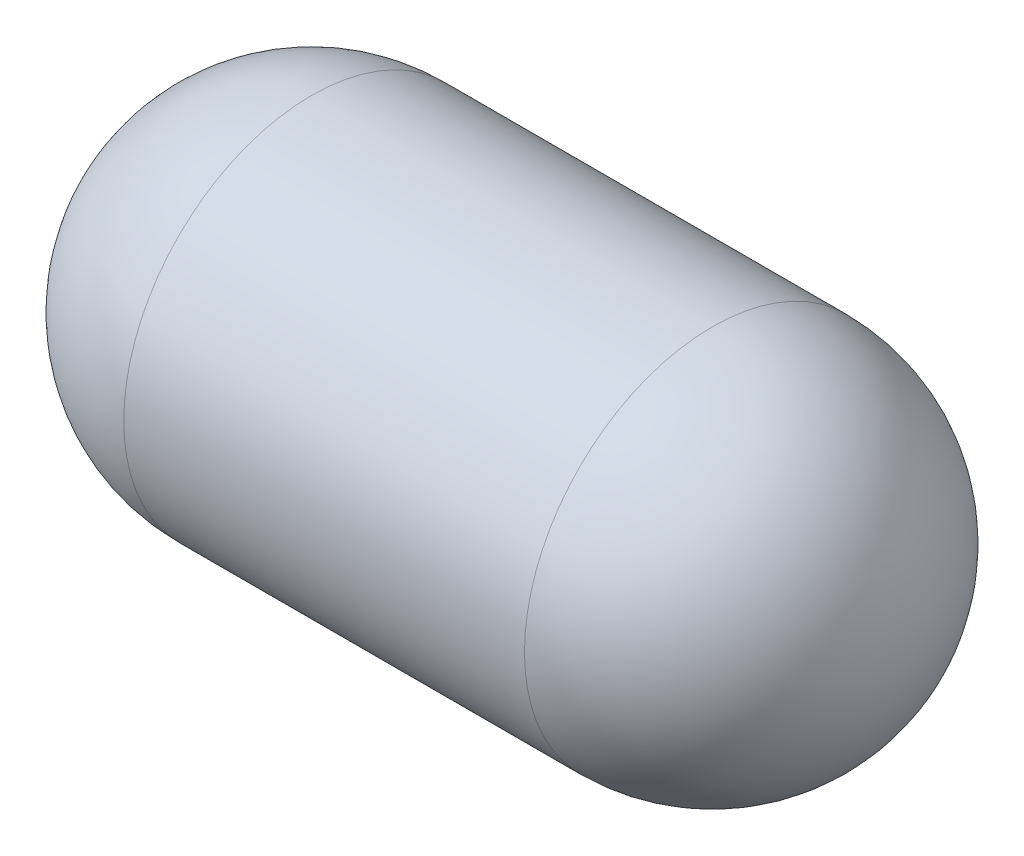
from build123d import *


with BuildPart() as part:
    # Sketch1 → Revolve-Thin1 (revolve)
    with BuildSketch(Plane.XY):
        with BuildLine():
            ThreePointArc((-155, 0), (-133.033008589, 53.033008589), (-80, 75))
            Line((-80, 75), (80, 75))
            ThreePointArc((80, 75), (133.033008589, 53.033008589), (155, 0))
            Line((155, 0), (152, 0))
            ThreePointArc((152, 0), (130.911688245, 50.911688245), (80, 72))
            Line((80, 72), (-80, 72))
            ThreePointArc((-80, 72), (-130.911688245, 50.911688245), (-152, 0))
            Line((-152, 0), (-155, 0))
        make_face()
    revolve(axis=Axis((-138.147777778, 0, 0), (1, 0, 0)))


solid = part.part
